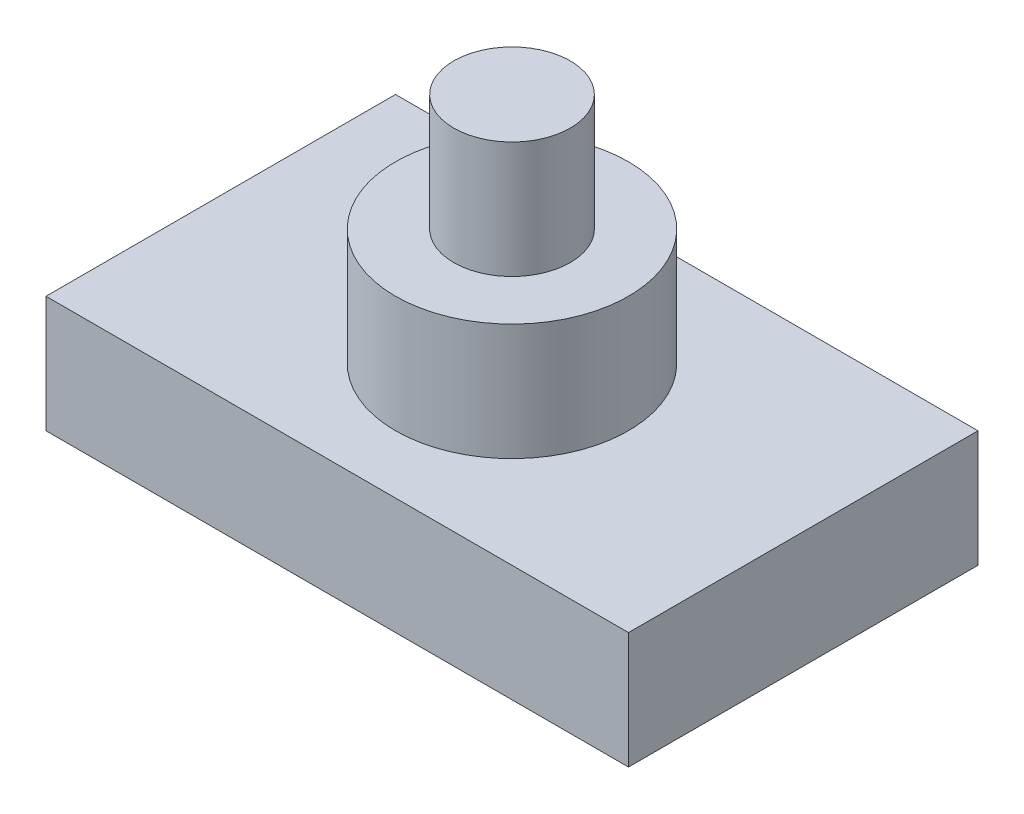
ISO-10303-21;
HEADER;
FILE_DESCRIPTION(('STEP AP214'),'2;1');
FILE_NAME('part.step','',(''),(''),'','','');
FILE_SCHEMA(('AUTOMOTIVE_DESIGN { 1 0 10303 214 1 1 1 1 }'));
ENDSEC;
DATA;
#1=APPLICATION_CONTEXT('core data for automotive mechanical design processes');
#2=APPLICATION_PROTOCOL_DEFINITION('international standard','automotive_design',2000,#1);
#3=PRODUCT_CONTEXT('',#1,'mechanical');
#4=PRODUCT('Part','Part','',(#3));
#5=PRODUCT_RELATED_PRODUCT_CATEGORY('part','',(#4));
#6=PRODUCT_DEFINITION_FORMATION('','',#4);
#7=PRODUCT_DEFINITION_CONTEXT('part definition',#1,'design');
#8=PRODUCT_DEFINITION('design','',#6,#7);
#9=PRODUCT_DEFINITION_SHAPE('','',#8);
#10=(LENGTH_UNIT() NAMED_UNIT(*) SI_UNIT(.MILLI.,.METRE.));
#11=(NAMED_UNIT(*) PLANE_ANGLE_UNIT() SI_UNIT($,.RADIAN.));
#12=(NAMED_UNIT(*) SI_UNIT($,.STERADIAN.) SOLID_ANGLE_UNIT());
#13=UNCERTAINTY_MEASURE_WITH_UNIT(LENGTH_MEASURE(1.E-05),#10,'distance_accuracy_value','');
#14=(GEOMETRIC_REPRESENTATION_CONTEXT(3) GLOBAL_UNCERTAINTY_ASSIGNED_CONTEXT((#13)) GLOBAL_UNIT_ASSIGNED_CONTEXT((#10,
#11,#12)) REPRESENTATION_CONTEXT('',''));
#15=CARTESIAN_POINT('',(0.,0.,0.));
#16=DIRECTION('',(0.,0.,1.));
#17=DIRECTION('',(1.,0.,0.));
#18=AXIS2_PLACEMENT_3D('',#15,#16,#17);
#19=CARTESIAN_POINT('',(25.,10.,15.));
#20=DIRECTION('',(-1.,0.,0.));
#21=DIRECTION('',(0.,0.,1.));
#22=AXIS2_PLACEMENT_3D('',#19,#20,#21);
#23=PLANE('',#22);
#24=DIRECTION('',(0.,0.,-1.));
#25=VECTOR('',#24,1.);
#26=CARTESIAN_POINT('',(25.,0.,15.));
#27=LINE('',#26,#25);
#28=CARTESIAN_POINT('',(25.,0.,15.));
#29=VERTEX_POINT('',#28);
#30=CARTESIAN_POINT('',(25.,0.,-15.));
#31=VERTEX_POINT('',#30);
#32=EDGE_CURVE('E100',#29,#31,#27,.T.);
#33=ORIENTED_EDGE('',*,*,#32,.T.);
#34=DIRECTION('',(0.,-1.,0.));
#35=VECTOR('',#34,1.);
#36=CARTESIAN_POINT('',(25.,10.,-15.));
#37=LINE('',#36,#35);
#38=CARTESIAN_POINT('',(25.,10.,-15.));
#39=VERTEX_POINT('',#38);
#40=EDGE_CURVE('E36',#39,#31,#37,.T.);
#41=ORIENTED_EDGE('',*,*,#40,.F.);
#42=DIRECTION('',(0.,0.,-1.));
#43=VECTOR('',#42,1.);
#44=CARTESIAN_POINT('',(25.,10.,15.));
#45=LINE('',#44,#43);
#46=CARTESIAN_POINT('',(25.,10.,15.));
#47=VERTEX_POINT('',#46);
#48=EDGE_CURVE('E87',#47,#39,#45,.T.);
#49=ORIENTED_EDGE('',*,*,#48,.F.);
#50=DIRECTION('',(0.,-1.,0.));
#51=VECTOR('',#50,1.);
#52=CARTESIAN_POINT('',(25.,10.,15.));
#53=LINE('',#52,#51);
#54=EDGE_CURVE('E96',#47,#29,#53,.T.);
#55=ORIENTED_EDGE('',*,*,#54,.T.);
#56=EDGE_LOOP('',(#33,#41,#49,#55));
#57=FACE_BOUND('',#56,.T.);
#58=ADVANCED_FACE('F33',(#57),#23,.F.);
#59=CARTESIAN_POINT('',(-25.,10.,-15.));
#60=DIRECTION('',(0.,0.,1.));
#61=DIRECTION('',(1.,0.,0.));
#62=AXIS2_PLACEMENT_3D('',#59,#60,#61);
#63=PLANE('',#62);
#64=DIRECTION('',(-1.,0.,0.));
#65=VECTOR('',#64,1.);
#66=CARTESIAN_POINT('',(-25.,0.,-15.));
#67=LINE('',#66,#65);
#68=CARTESIAN_POINT('',(-25.,0.,-15.));
#69=VERTEX_POINT('',#68);
#70=EDGE_CURVE('E92',#31,#69,#67,.T.);
#71=ORIENTED_EDGE('',*,*,#70,.T.);
#72=DIRECTION('',(0.,-1.,0.));
#73=VECTOR('',#72,1.);
#74=CARTESIAN_POINT('',(-25.,10.,-15.));
#75=LINE('',#74,#73);
#76=CARTESIAN_POINT('',(-25.,10.,-15.));
#77=VERTEX_POINT('',#76);
#78=EDGE_CURVE('E90',#77,#69,#75,.T.);
#79=ORIENTED_EDGE('',*,*,#78,.F.);
#80=DIRECTION('',(-1.,0.,0.));
#81=VECTOR('',#80,1.);
#82=CARTESIAN_POINT('',(-25.,10.,-15.));
#83=LINE('',#82,#81);
#84=EDGE_CURVE('E82',#39,#77,#83,.T.);
#85=ORIENTED_EDGE('',*,*,#84,.F.);
#86=ORIENTED_EDGE('',*,*,#40,.T.);
#87=EDGE_LOOP('',(#71,#79,#85,#86));
#88=FACE_BOUND('',#87,.T.);
#89=ADVANCED_FACE('F91',(#88),#63,.F.);
#90=CARTESIAN_POINT('',(-25.,10.,15.));
#91=DIRECTION('',(1.,0.,0.));
#92=DIRECTION('',(0.,0.,-1.));
#93=AXIS2_PLACEMENT_3D('',#90,#91,#92);
#94=PLANE('',#93);
#95=DIRECTION('',(0.,0.,1.));
#96=VECTOR('',#95,1.);
#97=CARTESIAN_POINT('',(-25.,0.,15.));
#98=LINE('',#97,#96);
#99=CARTESIAN_POINT('',(-25.,0.,15.));
#100=VERTEX_POINT('',#99);
#101=EDGE_CURVE('E68',#69,#100,#98,.T.);
#102=ORIENTED_EDGE('',*,*,#101,.T.);
#103=DIRECTION('',(0.,-1.,0.));
#104=VECTOR('',#103,1.);
#105=CARTESIAN_POINT('',(-25.,10.,15.));
#106=LINE('',#105,#104);
#107=CARTESIAN_POINT('',(-25.,10.,15.));
#108=VERTEX_POINT('',#107);
#109=EDGE_CURVE('E93',#108,#100,#106,.T.);
#110=ORIENTED_EDGE('',*,*,#109,.F.);
#111=DIRECTION('',(0.,0.,1.));
#112=VECTOR('',#111,1.);
#113=CARTESIAN_POINT('',(-25.,10.,15.));
#114=LINE('',#113,#112);
#115=EDGE_CURVE('E85',#77,#108,#114,.T.);
#116=ORIENTED_EDGE('',*,*,#115,.F.);
#117=ORIENTED_EDGE('',*,*,#78,.T.);
#118=EDGE_LOOP('',(#102,#110,#116,#117));
#119=FACE_BOUND('',#118,.T.);
#120=ADVANCED_FACE('F94',(#119),#94,.F.);
#121=CARTESIAN_POINT('',(-25.,10.,15.));
#122=DIRECTION('',(0.,0.,-1.));
#123=DIRECTION('',(-1.,0.,0.));
#124=AXIS2_PLACEMENT_3D('',#121,#122,#123);
#125=PLANE('',#124);
#126=DIRECTION('',(1.,0.,0.));
#127=VECTOR('',#126,1.);
#128=CARTESIAN_POINT('',(-25.,0.,15.));
#129=LINE('',#128,#127);
#130=EDGE_CURVE('E74',#100,#29,#129,.T.);
#131=ORIENTED_EDGE('',*,*,#130,.T.);
#132=ORIENTED_EDGE('',*,*,#54,.F.);
#133=DIRECTION('',(1.,0.,0.));
#134=VECTOR('',#133,1.);
#135=CARTESIAN_POINT('',(-25.,10.,15.));
#136=LINE('',#135,#134);
#137=EDGE_CURVE('E51',#108,#47,#136,.T.);
#138=ORIENTED_EDGE('',*,*,#137,.F.);
#139=ORIENTED_EDGE('',*,*,#109,.T.);
#140=EDGE_LOOP('',(#131,#132,#138,#139));
#141=FACE_BOUND('',#140,.T.);
#142=ADVANCED_FACE('F108',(#141),#125,.F.);
#143=CARTESIAN_POINT('',(0.,10.,0.));
#144=DIRECTION('',(0.,-1.,0.));
#145=DIRECTION('',(0.,0.,-1.));
#146=AXIS2_PLACEMENT_3D('',#143,#144,#145);
#147=PLANE('',#146);
#148=CARTESIAN_POINT('',(0.,10.,0.));
#149=DIRECTION('',(0.,1.,0.));
#150=DIRECTION('',(0.,0.,1.));
#151=AXIS2_PLACEMENT_3D('',#148,#149,#150);
#152=CIRCLE('',#151,10.);
#153=CARTESIAN_POINT('',(0.,10.,10.));
#154=VERTEX_POINT('',#153);
#155=EDGE_CURVE('E42',#154,#154,#152,.T.);
#156=ORIENTED_EDGE('',*,*,#155,.F.);
#157=EDGE_LOOP('',(#156));
#158=FACE_BOUND('',#157,.T.);
#159=ORIENTED_EDGE('',*,*,#48,.T.);
#160=ORIENTED_EDGE('',*,*,#84,.T.);
#161=ORIENTED_EDGE('',*,*,#115,.T.);
#162=ORIENTED_EDGE('',*,*,#137,.T.);
#163=EDGE_LOOP('',(#159,#160,#161,#162));
#164=FACE_BOUND('',#163,.T.);
#165=ADVANCED_FACE('F83',(#158,#164),#147,.F.);
#166=CARTESIAN_POINT('',(0.,0.,0.));
#167=DIRECTION('',(0.,-1.,0.));
#168=DIRECTION('',(0.,0.,-1.));
#169=AXIS2_PLACEMENT_3D('',#166,#167,#168);
#170=PLANE('',#169);
#171=ORIENTED_EDGE('',*,*,#32,.F.);
#172=ORIENTED_EDGE('',*,*,#130,.F.);
#173=ORIENTED_EDGE('',*,*,#101,.F.);
#174=ORIENTED_EDGE('',*,*,#70,.F.);
#175=EDGE_LOOP('',(#171,#172,#173,#174));
#176=FACE_BOUND('',#175,.T.);
#177=ADVANCED_FACE('F111',(#176),#170,.T.);
#178=CARTESIAN_POINT('',(0.,20.,0.));
#179=DIRECTION('',(0.,-1.,0.));
#180=DIRECTION('',(0.,0.,-1.));
#181=AXIS2_PLACEMENT_3D('',#178,#179,#180);
#182=CYLINDRICAL_SURFACE('',#181,10.);
#183=CARTESIAN_POINT('',(0.,20.,0.));
#184=DIRECTION('',(0.,1.,0.));
#185=DIRECTION('',(0.,0.,1.));
#186=AXIS2_PLACEMENT_3D('',#183,#184,#185);
#187=CIRCLE('',#186,10.);
#188=CARTESIAN_POINT('',(0.,20.,10.));
#189=VERTEX_POINT('',#188);
#190=EDGE_CURVE('E103',#189,#189,#187,.T.);
#191=ORIENTED_EDGE('',*,*,#190,.F.);
#192=EDGE_LOOP('',(#191));
#193=FACE_BOUND('',#192,.T.);
#194=ORIENTED_EDGE('',*,*,#155,.T.);
#195=EDGE_LOOP('',(#194));
#196=FACE_BOUND('',#195,.T.);
#197=ADVANCED_FACE('F133',(#193,#196),#182,.T.);
#198=CARTESIAN_POINT('',(0.,20.,0.));
#199=DIRECTION('',(0.,1.,0.));
#200=DIRECTION('',(0.,0.,1.));
#201=AXIS2_PLACEMENT_3D('',#198,#199,#200);
#202=PLANE('',#201);
#203=CARTESIAN_POINT('',(0.,20.,0.));
#204=DIRECTION('',(0.,1.,0.));
#205=DIRECTION('',(0.,0.,1.));
#206=AXIS2_PLACEMENT_3D('',#203,#204,#205);
#207=CIRCLE('',#206,5.);
#208=CARTESIAN_POINT('',(0.,20.,5.));
#209=VERTEX_POINT('',#208);
#210=EDGE_CURVE('E11',#209,#209,#207,.T.);
#211=ORIENTED_EDGE('',*,*,#210,.F.);
#212=EDGE_LOOP('',(#211));
#213=FACE_BOUND('',#212,.T.);
#214=ORIENTED_EDGE('',*,*,#190,.T.);
#215=EDGE_LOOP('',(#214));
#216=FACE_BOUND('',#215,.T.);
#217=ADVANCED_FACE('F127',(#213,#216),#202,.T.);
#218=CARTESIAN_POINT('',(0.,30.,0.));
#219=DIRECTION('',(0.,-1.,0.));
#220=DIRECTION('',(0.,0.,-1.));
#221=AXIS2_PLACEMENT_3D('',#218,#219,#220);
#222=CYLINDRICAL_SURFACE('',#221,5.);
#223=CARTESIAN_POINT('',(0.,30.,0.));
#224=DIRECTION('',(0.,1.,0.));
#225=DIRECTION('',(0.,0.,1.));
#226=AXIS2_PLACEMENT_3D('',#223,#224,#225);
#227=CIRCLE('',#226,5.);
#228=CARTESIAN_POINT('',(0.,30.,5.));
#229=VERTEX_POINT('',#228);
#230=EDGE_CURVE('E117',#229,#229,#227,.T.);
#231=ORIENTED_EDGE('',*,*,#230,.F.);
#232=EDGE_LOOP('',(#231));
#233=FACE_BOUND('',#232,.T.);
#234=ORIENTED_EDGE('',*,*,#210,.T.);
#235=EDGE_LOOP('',(#234));
#236=FACE_BOUND('',#235,.T.);
#237=ADVANCED_FACE('F124',(#233,#236),#222,.T.);
#238=CARTESIAN_POINT('',(0.,30.,0.));
#239=DIRECTION('',(0.,1.,0.));
#240=DIRECTION('',(0.,0.,1.));
#241=AXIS2_PLACEMENT_3D('',#238,#239,#240);
#242=PLANE('',#241);
#243=ORIENTED_EDGE('',*,*,#230,.T.);
#244=EDGE_LOOP('',(#243));
#245=FACE_BOUND('',#244,.T.);
#246=ADVANCED_FACE('F122',(#245),#242,.T.);
#247=CLOSED_SHELL('',(#58,#89,#120,#142,#165,#177,#197,#217,#237,#246));
#248=MANIFOLD_SOLID_BREP('B2',#247);
#249=ADVANCED_BREP_SHAPE_REPRESENTATION('',(#18,#248),#14);
#250=SHAPE_DEFINITION_REPRESENTATION(#9,#249);
ENDSEC;
END-ISO-10303-21;
